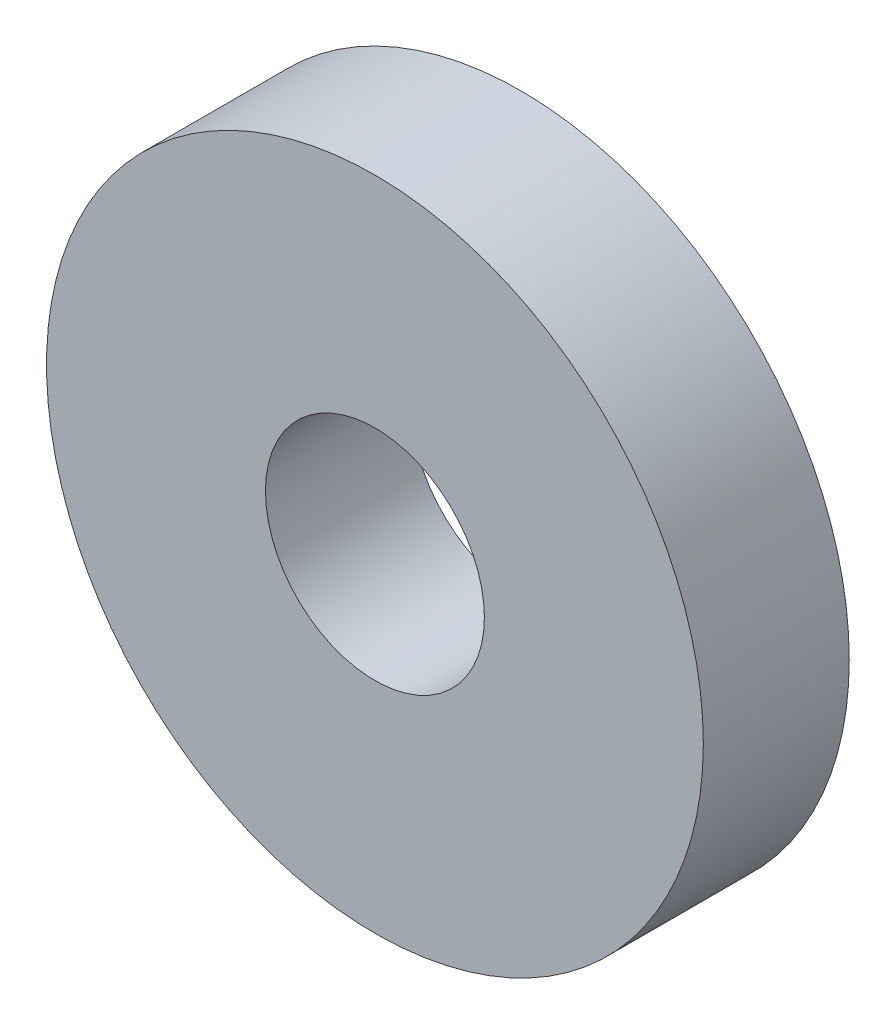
from build123d import *

# Parameters (mm, degrees)
SKETCH1_R           = 4.5
SKETCH1_R_2         = 1.5
BOSS_EXTRUDE1_DEPTH = 2


with BuildPart() as part:
    # Sketch1 → Boss-Extrude1 (new body)
    with BuildSketch(Plane.XY):
        Circle(SKETCH1_R)
        Circle(SKETCH1_R_2, mode=Mode.SUBTRACT)
    extrude(amount=BOSS_EXTRUDE1_DEPTH)


solid = part.part
